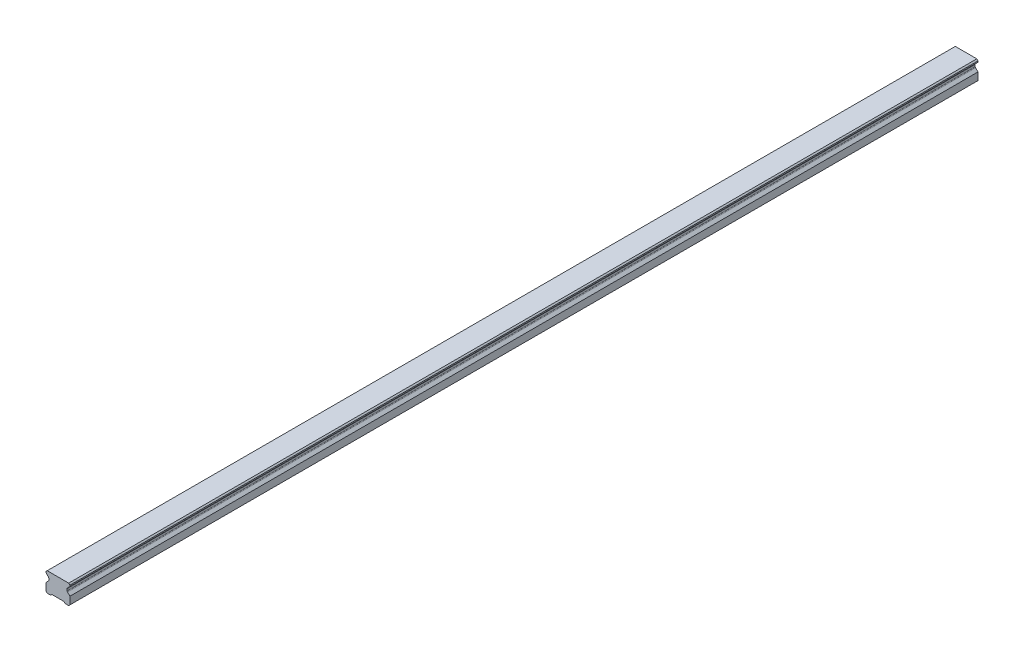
from build123d import *

# Parameters (mm, degrees)
SKETCH1_W           = 20
SKETCH1_H           = 16.3
BOSS_EXTRUDE1_DEPTH = 380
CUT_EXTRUDE1_DEPTH  = 761.240547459
CHAMFER1_SIZE       = 1
FILLET1_R           = 1
CUT_EXTRUDE2_DEPTH  = 761.240547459
SKETCH5_R           = 3
SKETCH5_R_2         = 2.5
CUT_EXTRUDE5_DEPTH  = 10
SKETCH5_2_R         = 2.5
CUT_EXTRUDE6_DEPTH  = 13
LPATTERN2_COUNT     = 13
LPATTERN2_PITCH     = 60


with BuildPart() as part:
    # Sketch1 → Boss-Extrude1 (new, symmetric)
    with BuildSketch(Plane.XY):
        with Locations((0, 8.15)):
            Rectangle(SKETCH1_W, SKETCH1_H)
    extrude(amount=BOSS_EXTRUDE1_DEPTH, both=True)

    # Sketch2 → Cut-Extrude1 (cut, through all)
    with BuildSketch(Plane.XY.offset(380)):
        Polygon((-10, 14.3), (-10, 7.3), (-7.666666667, 9.633333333), (-7.666666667, 11.966666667), align=None)
        Polygon((7.666666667, 11.966666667), (10, 14.3), (10, 7.3), (7.666666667, 9.633333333), align=None)
    extrude(amount=-CUT_EXTRUDE1_DEPTH, mode=Mode.SUBTRACT)

    # Chamfer1
    chamfer1_edges = [part.edges().sort_by_distance(p)[0] for p in [
        (-10, 16.3, 0),
        (10, 16.3, 0),
        (10, 0, 0),
        (-10, 0, 0),
    ]]
    chamfer(chamfer1_edges, length=CHAMFER1_SIZE)

    # Fillet1
    fillet1_edges = [part.edges().sort_by_distance(p)[0] for p in [
        (-7.666666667, 11.966666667, 0),
        (-7.666666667, 9.633333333, 0),
        (7.666666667, 9.633333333, 0),
        (7.666666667, 11.966666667, 0),
    ]]
    fillet(fillet1_edges, radius=FILLET1_R)

    # Sketch3 → Cut-Extrude2 (cut, through all)
    with BuildSketch(Plane.XY.offset(380)):
        Polygon((-6, 0), (-5, 1), (5, 1), (6, 0), align=None)
    extrude(amount=-CUT_EXTRUDE2_DEPTH, mode=Mode.SUBTRACT)

    # Sketch5 → Cut-Extrude5 (cut)
    with BuildSketch(Plane.XZ.offset(-1)):
        with Locations(Location((0, 360, 0), (0, 0, 270))):
            Circle(SKETCH5_R)
        with Locations(Location((0, 360, 0), (0, 0, 270))):
            Circle(SKETCH5_R_2, mode=Mode.SUBTRACT)
    cut_extrude5 = extrude(amount=-CUT_EXTRUDE5_DEPTH, mode=Mode.SUBTRACT)

    # Sketch5_2 → Cut-Extrude6 (cut)
    with BuildSketch(Plane.XZ.offset(-1)):
        with Locations(Location((0, 360, 0), (0, 0, 270))):
            Circle(SKETCH5_2_R)
    cut_extrude6 = extrude(amount=-CUT_EXTRUDE6_DEPTH, mode=Mode.SUBTRACT)

    # Cut-Extrude7 cone 1 section (on through the dimple's axis) → Cut-Extrude7 (revolve, cut)
    with BuildSketch(Plane(origin=(0, 14, 360), x_dir=(0, 0, -1), z_dir=(1, 0, 0))):
        Polygon((0, 0), (2.5, 0), (0, 1.443375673), align=None)
    cut_extrude7 = revolve(axis=Axis((0, 14, 360), (0, 1, 0)), mode=Mode.SUBTRACT)

    # LPattern2: Cut-Extrude5, Cut-Extrude6, Cut-Extrude7 ×13
    with Locations(*[(0, 0, -i * LPATTERN2_PITCH) for i in range(1, LPATTERN2_COUNT)]):
        add(cut_extrude5, mode=Mode.SUBTRACT)
        add(cut_extrude6, mode=Mode.SUBTRACT)
        add(cut_extrude7, mode=Mode.SUBTRACT)


solid = part.part
